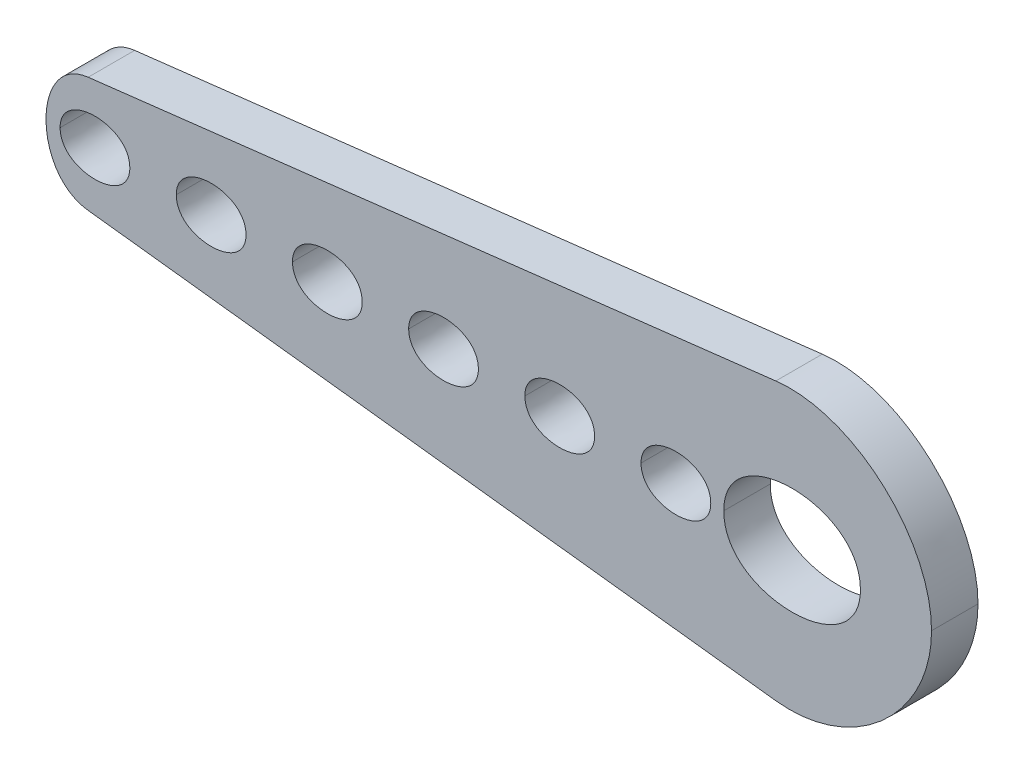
ISO-10303-21;
HEADER;
FILE_DESCRIPTION(('STEP AP214'),'2;1');
FILE_NAME('part.step','',(''),(''),'','','');
FILE_SCHEMA(('AUTOMOTIVE_DESIGN { 1 0 10303 214 1 1 1 1 }'));
ENDSEC;
DATA;
#1=APPLICATION_CONTEXT('core data for automotive mechanical design processes');
#2=APPLICATION_PROTOCOL_DEFINITION('international standard','automotive_design',2000,#1);
#3=PRODUCT_CONTEXT('',#1,'mechanical');
#4=PRODUCT('Part','Part','',(#3));
#5=PRODUCT_RELATED_PRODUCT_CATEGORY('part','',(#4));
#6=PRODUCT_DEFINITION_FORMATION('','',#4);
#7=PRODUCT_DEFINITION_CONTEXT('part definition',#1,'design');
#8=PRODUCT_DEFINITION('design','',#6,#7);
#9=PRODUCT_DEFINITION_SHAPE('','',#8);
#10=(LENGTH_UNIT() NAMED_UNIT(*) SI_UNIT(.MILLI.,.METRE.));
#11=(NAMED_UNIT(*) PLANE_ANGLE_UNIT() SI_UNIT($,.RADIAN.));
#12=(NAMED_UNIT(*) SI_UNIT($,.STERADIAN.) SOLID_ANGLE_UNIT());
#13=UNCERTAINTY_MEASURE_WITH_UNIT(LENGTH_MEASURE(1.E-05),#10,'distance_accuracy_value','');
#14=(GEOMETRIC_REPRESENTATION_CONTEXT(3) GLOBAL_UNCERTAINTY_ASSIGNED_CONTEXT((#13)) GLOBAL_UNIT_ASSIGNED_CONTEXT((#10,
#11,#12)) REPRESENTATION_CONTEXT('',''));
#15=CARTESIAN_POINT('',(0.,0.,0.));
#16=DIRECTION('',(0.,0.,1.));
#17=DIRECTION('',(1.,0.,0.));
#18=AXIS2_PLACEMENT_3D('',#15,#16,#17);
#19=CARTESIAN_POINT('',(-2.07030057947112,-2.48292080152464,0.));
#20=CARTESIAN_POINT('',(7.79356408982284,-3.64166624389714,0.));
#21=CARTESIAN_POINT('',(17.6574665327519,-4.80033307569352,0.));
#22=CARTESIAN_POINT('',(27.5213652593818,-5.95902676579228,0.));
#23=B_SPLINE_CURVE_WITH_KNOTS('',3,(#19,#20,#21,#22),.UNSPECIFIED.,.F.,.F.,(4,4),(0.,1.),.UNSPECIFIED.);
#24=DIRECTION('',(0.,0.,1.));
#25=VECTOR('',#24,1.);
#26=SURFACE_OF_LINEAR_EXTRUSION('',#23,#25);
#27=CARTESIAN_POINT('',(-2.07030057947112,-2.48292080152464,2.));
#28=CARTESIAN_POINT('',(7.79356408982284,-3.64166624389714,2.));
#29=CARTESIAN_POINT('',(17.6574665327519,-4.80033307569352,2.));
#30=CARTESIAN_POINT('',(27.5213652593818,-5.95902676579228,2.));
#31=B_SPLINE_CURVE_WITH_KNOTS('',3,(#27,#28,#29,#30),.UNSPECIFIED.,.F.,.F.,(4,4),(0.,1.),.UNSPECIFIED.);
#32=CARTESIAN_POINT('',(-2.07030057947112,-2.48292080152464,2.));
#33=VERTEX_POINT('',#32);
#34=CARTESIAN_POINT('',(27.5213652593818,-5.95902676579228,2.));
#35=VERTEX_POINT('',#34);
#36=EDGE_CURVE('E412',#33,#35,#31,.T.);
#37=ORIENTED_EDGE('',*,*,#36,.F.);
#38=DIRECTION('',(0.,0.,1.));
#39=VECTOR('',#38,1.);
#40=CARTESIAN_POINT('',(-2.07030057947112,-2.48292080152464,0.));
#41=LINE('',#40,#39);
#42=CARTESIAN_POINT('',(-2.07030057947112,-2.48292080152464,0.));
#43=VERTEX_POINT('',#42);
#44=EDGE_CURVE('E11',#43,#33,#41,.T.);
#45=ORIENTED_EDGE('',*,*,#44,.F.);
#46=CARTESIAN_POINT('',(27.5213652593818,-5.95902676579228,0.));
#47=VERTEX_POINT('',#46);
#48=EDGE_CURVE('E452',#43,#47,#23,.T.);
#49=ORIENTED_EDGE('',*,*,#48,.T.);
#50=DIRECTION('',(0.,0.,1.));
#51=VECTOR('',#50,1.);
#52=CARTESIAN_POINT('',(27.5213652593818,-5.95902676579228,0.));
#53=LINE('',#52,#51);
#54=EDGE_CURVE('E37',#47,#35,#53,.T.);
#55=ORIENTED_EDGE('',*,*,#54,.T.);
#56=EDGE_LOOP('',(#37,#45,#49,#55));
#57=FACE_BOUND('',#56,.T.);
#58=ADVANCED_FACE('F33',(#57),#26,.T.);
#59=CARTESIAN_POINT('',(-2.07030002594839,2.4829160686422,0.));
#60=CARTESIAN_POINT('',(-4.49434606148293,2.19810123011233,0.));
#61=CARTESIAN_POINT('',(-4.48732922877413,-2.19895314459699,0.));
#62=CARTESIAN_POINT('',(-2.07030057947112,-2.48292080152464,0.));
#63=B_SPLINE_CURVE_WITH_KNOTS('',3,(#59,#60,#61,#62),.UNSPECIFIED.,.F.,.F.,(4,4),(0.,1.),.UNSPECIFIED.);
#64=DIRECTION('',(0.,0.,1.));
#65=VECTOR('',#64,1.);
#66=SURFACE_OF_LINEAR_EXTRUSION('',#63,#65);
#67=CARTESIAN_POINT('',(-2.07030002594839,2.4829160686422,2.));
#68=CARTESIAN_POINT('',(-4.49434606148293,2.19810123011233,2.));
#69=CARTESIAN_POINT('',(-4.48732922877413,-2.19895314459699,2.));
#70=CARTESIAN_POINT('',(-2.07030057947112,-2.48292080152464,2.));
#71=B_SPLINE_CURVE_WITH_KNOTS('',3,(#67,#68,#69,#70),.UNSPECIFIED.,.F.,.F.,(4,4),(0.,1.),.UNSPECIFIED.);
#72=CARTESIAN_POINT('',(-2.07030002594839,2.4829160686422,2.));
#73=VERTEX_POINT('',#72);
#74=EDGE_CURVE('E445',#73,#33,#71,.T.);
#75=ORIENTED_EDGE('',*,*,#74,.F.);
#76=DIRECTION('',(0.,0.,1.));
#77=VECTOR('',#76,1.);
#78=CARTESIAN_POINT('',(-2.07030002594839,2.4829160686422,0.));
#79=LINE('',#78,#77);
#80=CARTESIAN_POINT('',(-2.07030002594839,2.4829160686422,0.));
#81=VERTEX_POINT('',#80);
#82=EDGE_CURVE('E42',#81,#73,#79,.T.);
#83=ORIENTED_EDGE('',*,*,#82,.F.);
#84=EDGE_CURVE('E401',#81,#43,#63,.T.);
#85=ORIENTED_EDGE('',*,*,#84,.T.);
#86=ORIENTED_EDGE('',*,*,#44,.T.);
#87=EDGE_LOOP('',(#75,#83,#85,#86));
#88=FACE_BOUND('',#87,.T.);
#89=ADVANCED_FACE('F393',(#88),#66,.T.);
#90=CARTESIAN_POINT('',(27.5213652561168,5.95902676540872,0.));
#91=CARTESIAN_POINT('',(17.6574598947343,4.80033709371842,0.));
#92=CARTESIAN_POINT('',(7.79354792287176,3.64169226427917,0.));
#93=CARTESIAN_POINT('',(-2.07030002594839,2.4829160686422,0.));
#94=B_SPLINE_CURVE_WITH_KNOTS('',3,(#90,#91,#92,#93),.UNSPECIFIED.,.F.,.F.,(4,4),(0.,1.),.UNSPECIFIED.);
#95=DIRECTION('',(0.,0.,1.));
#96=VECTOR('',#95,1.);
#97=SURFACE_OF_LINEAR_EXTRUSION('',#94,#96);
#98=CARTESIAN_POINT('',(27.5213652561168,5.95902676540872,2.));
#99=CARTESIAN_POINT('',(17.6574598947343,4.80033709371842,2.));
#100=CARTESIAN_POINT('',(7.79354792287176,3.64169226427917,2.));
#101=CARTESIAN_POINT('',(-2.07030002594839,2.4829160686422,2.));
#102=B_SPLINE_CURVE_WITH_KNOTS('',3,(#98,#99,#100,#101),.UNSPECIFIED.,.F.,.F.,(4,4),(0.,1.),.UNSPECIFIED.);
#103=CARTESIAN_POINT('',(27.5213652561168,5.95902676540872,2.));
#104=VERTEX_POINT('',#103);
#105=EDGE_CURVE('E437',#104,#73,#102,.T.);
#106=ORIENTED_EDGE('',*,*,#105,.F.);
#107=DIRECTION('',(0.,0.,1.));
#108=VECTOR('',#107,1.);
#109=CARTESIAN_POINT('',(27.5213652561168,5.95902676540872,0.));
#110=LINE('',#109,#108);
#111=CARTESIAN_POINT('',(27.5213652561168,5.95902676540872,0.));
#112=VERTEX_POINT('',#111);
#113=EDGE_CURVE('E458',#112,#104,#110,.T.);
#114=ORIENTED_EDGE('',*,*,#113,.F.);
#115=EDGE_CURVE('E407',#112,#81,#94,.T.);
#116=ORIENTED_EDGE('',*,*,#115,.T.);
#117=ORIENTED_EDGE('',*,*,#82,.T.);
#118=EDGE_LOOP('',(#106,#114,#116,#117));
#119=FACE_BOUND('',#118,.T.);
#120=ADVANCED_FACE('F397',(#119),#97,.T.);
#121=CARTESIAN_POINT('',(34.2213544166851,-3.87570184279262E-10,0.));
#122=CARTESIAN_POINT('',(34.2212300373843,3.32809834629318,0.));
#123=CARTESIAN_POINT('',(30.891057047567,6.354568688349,0.));
#124=CARTESIAN_POINT('',(27.5213652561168,5.95902676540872,0.));
#125=B_SPLINE_CURVE_WITH_KNOTS('',3,(#121,#122,#123,#124),.UNSPECIFIED.,.F.,.F.,(4,4),(0.,1.),.UNSPECIFIED.);
#126=DIRECTION('',(0.,0.,1.));
#127=VECTOR('',#126,1.);
#128=SURFACE_OF_LINEAR_EXTRUSION('',#125,#127);
#129=CARTESIAN_POINT('',(34.2213544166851,-3.87570184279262E-10,2.));
#130=CARTESIAN_POINT('',(34.2212300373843,3.32809834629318,2.));
#131=CARTESIAN_POINT('',(30.891057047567,6.354568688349,2.));
#132=CARTESIAN_POINT('',(27.5213652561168,5.95902676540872,2.));
#133=B_SPLINE_CURVE_WITH_KNOTS('',3,(#129,#130,#131,#132),.UNSPECIFIED.,.F.,.F.,(4,4),(0.,1.),.UNSPECIFIED.);
#134=CARTESIAN_POINT('',(34.2213544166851,-3.87570184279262E-10,2.));
#135=VERTEX_POINT('',#134);
#136=EDGE_CURVE('E429',#135,#104,#133,.T.);
#137=ORIENTED_EDGE('',*,*,#136,.F.);
#138=DIRECTION('',(0.,0.,1.));
#139=VECTOR('',#138,1.);
#140=CARTESIAN_POINT('',(34.2213544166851,-3.87570184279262E-10,0.));
#141=LINE('',#140,#139);
#142=CARTESIAN_POINT('',(34.2213544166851,-3.87570184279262E-10,0.));
#143=VERTEX_POINT('',#142);
#144=EDGE_CURVE('E459',#143,#135,#141,.T.);
#145=ORIENTED_EDGE('',*,*,#144,.F.);
#146=EDGE_CURVE('E478',#143,#112,#125,.T.);
#147=ORIENTED_EDGE('',*,*,#146,.T.);
#148=ORIENTED_EDGE('',*,*,#113,.T.);
#149=EDGE_LOOP('',(#137,#145,#147,#148));
#150=FACE_BOUND('',#149,.T.);
#151=ADVANCED_FACE('F499',(#150),#128,.T.);
#152=CARTESIAN_POINT('',(27.5213652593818,-5.95902676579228,0.));
#153=CARTESIAN_POINT('',(30.8889448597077,-6.35432075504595,0.));
#154=CARTESIAN_POINT('',(34.2214681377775,-3.32435910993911,0.));
#155=CARTESIAN_POINT('',(34.2213544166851,-3.87570184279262E-10,0.));
#156=B_SPLINE_CURVE_WITH_KNOTS('',3,(#152,#153,#154,#155),.UNSPECIFIED.,.F.,.F.,(4,4),(0.,1.),.UNSPECIFIED.);
#157=DIRECTION('',(0.,0.,1.));
#158=VECTOR('',#157,1.);
#159=SURFACE_OF_LINEAR_EXTRUSION('',#156,#158);
#160=CARTESIAN_POINT('',(27.5213652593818,-5.95902676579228,2.));
#161=CARTESIAN_POINT('',(30.8889448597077,-6.35432075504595,2.));
#162=CARTESIAN_POINT('',(34.2214681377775,-3.32435910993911,2.));
#163=CARTESIAN_POINT('',(34.2213544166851,-3.87570184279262E-10,2.));
#164=B_SPLINE_CURVE_WITH_KNOTS('',3,(#160,#161,#162,#163),.UNSPECIFIED.,.F.,.F.,(4,4),(0.,1.),.UNSPECIFIED.);
#165=EDGE_CURVE('E420',#35,#135,#164,.T.);
#166=ORIENTED_EDGE('',*,*,#165,.F.);
#167=ORIENTED_EDGE('',*,*,#54,.F.);
#168=EDGE_CURVE('E477',#47,#143,#156,.T.);
#169=ORIENTED_EDGE('',*,*,#168,.T.);
#170=ORIENTED_EDGE('',*,*,#144,.T.);
#171=EDGE_LOOP('',(#166,#167,#169,#170));
#172=FACE_BOUND('',#171,.T.);
#173=ADVANCED_FACE('F389',(#172),#159,.T.);
#174=CARTESIAN_POINT('',(12.7255195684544,-4.22099319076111,0.));
#175=DIRECTION('',(0.,0.,-1.));
#176=DIRECTION('',(-1.,0.,0.));
#177=AXIS2_PLACEMENT_3D('',#174,#175,#176);
#178=PLANE('',#177);
#179=CARTESIAN_POINT('',(9.72136526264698,0.,0.));
#180=CARTESIAN_POINT('',(9.72136526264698,1.57079632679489,0.));
#181=CARTESIAN_POINT('',(6.72136526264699,1.5707963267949,0.));
#182=CARTESIAN_POINT('',(6.72136526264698,0.,0.));
#183=B_SPLINE_CURVE_WITH_KNOTS('',3,(#179,#180,#181,#182),.UNSPECIFIED.,.F.,.F.,(4,4),(0.,1.),.UNSPECIFIED.);
#184=CARTESIAN_POINT('',(9.72136526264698,0.,0.));
#185=VERTEX_POINT('',#184);
#186=CARTESIAN_POINT('',(6.72136526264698,0.,0.));
#187=VERTEX_POINT('',#186);
#188=EDGE_CURVE('E50',#185,#187,#183,.T.);
#189=ORIENTED_EDGE('',*,*,#188,.T.);
#190=CARTESIAN_POINT('',(6.72136526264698,0.,0.));
#191=CARTESIAN_POINT('',(6.72136526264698,-1.5707963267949,0.));
#192=CARTESIAN_POINT('',(9.72136526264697,-1.5707963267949,0.));
#193=CARTESIAN_POINT('',(9.72136526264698,0.,0.));
#194=B_SPLINE_CURVE_WITH_KNOTS('',3,(#190,#191,#192,#193),.UNSPECIFIED.,.F.,.F.,(4,4),(0.,1.),.UNSPECIFIED.);
#195=EDGE_CURVE('E168',#187,#185,#194,.T.);
#196=ORIENTED_EDGE('',*,*,#195,.T.);
#197=EDGE_LOOP('',(#189,#196));
#198=FACE_BOUND('',#197,.T.);
#199=CARTESIAN_POINT('',(4.72136526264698,0.,0.));
#200=CARTESIAN_POINT('',(4.72136526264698,1.57079632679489,0.));
#201=CARTESIAN_POINT('',(1.72136526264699,1.5707963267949,0.));
#202=CARTESIAN_POINT('',(1.72136526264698,0.,0.));
#203=B_SPLINE_CURVE_WITH_KNOTS('',3,(#199,#200,#201,#202),.UNSPECIFIED.,.F.,.F.,(4,4),(0.,1.),.UNSPECIFIED.);
#204=CARTESIAN_POINT('',(4.72136526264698,0.,0.));
#205=VERTEX_POINT('',#204);
#206=CARTESIAN_POINT('',(1.72136526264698,0.,0.));
#207=VERTEX_POINT('',#206);
#208=EDGE_CURVE('E208',#205,#207,#203,.T.);
#209=ORIENTED_EDGE('',*,*,#208,.T.);
#210=CARTESIAN_POINT('',(1.72136526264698,0.,0.));
#211=CARTESIAN_POINT('',(1.72136526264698,-1.5707963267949,0.));
#212=CARTESIAN_POINT('',(4.72136526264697,-1.5707963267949,0.));
#213=CARTESIAN_POINT('',(4.72136526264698,0.,0.));
#214=B_SPLINE_CURVE_WITH_KNOTS('',3,(#210,#211,#212,#213),.UNSPECIFIED.,.F.,.F.,(4,4),(0.,1.),.UNSPECIFIED.);
#215=EDGE_CURVE('E201',#207,#205,#214,.T.);
#216=ORIENTED_EDGE('',*,*,#215,.T.);
#217=EDGE_LOOP('',(#209,#216));
#218=FACE_BOUND('',#217,.T.);
#219=CARTESIAN_POINT('',(-0.27863473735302,0.,0.));
#220=CARTESIAN_POINT('',(-0.278634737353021,1.5707963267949,0.));
#221=CARTESIAN_POINT('',(-3.27863473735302,1.5707963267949,0.));
#222=CARTESIAN_POINT('',(-3.27863473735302,0.,0.));
#223=B_SPLINE_CURVE_WITH_KNOTS('',3,(#219,#220,#221,#222),.UNSPECIFIED.,.F.,.F.,(4,4),(0.,1.),.UNSPECIFIED.);
#224=CARTESIAN_POINT('',(-0.27863473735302,0.,0.));
#225=VERTEX_POINT('',#224);
#226=CARTESIAN_POINT('',(-3.27863473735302,0.,0.));
#227=VERTEX_POINT('',#226);
#228=EDGE_CURVE('E235',#225,#227,#223,.T.);
#229=ORIENTED_EDGE('',*,*,#228,.T.);
#230=CARTESIAN_POINT('',(-3.27863473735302,0.,0.));
#231=CARTESIAN_POINT('',(-3.27863473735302,-1.5707963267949,0.));
#232=CARTESIAN_POINT('',(-0.278634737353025,-1.5707963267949,0.));
#233=CARTESIAN_POINT('',(-0.27863473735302,0.,0.));
#234=B_SPLINE_CURVE_WITH_KNOTS('',3,(#230,#231,#232,#233),.UNSPECIFIED.,.F.,.F.,(4,4),(0.,1.),.UNSPECIFIED.);
#235=EDGE_CURVE('E241',#227,#225,#234,.T.);
#236=ORIENTED_EDGE('',*,*,#235,.T.);
#237=EDGE_LOOP('',(#229,#236));
#238=FACE_BOUND('',#237,.T.);
#239=CARTESIAN_POINT('',(14.721365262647,0.,0.));
#240=CARTESIAN_POINT('',(14.721365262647,1.5707963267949,0.));
#241=CARTESIAN_POINT('',(11.721365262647,1.5707963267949,0.));
#242=CARTESIAN_POINT('',(11.721365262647,0.,0.));
#243=B_SPLINE_CURVE_WITH_KNOTS('',3,(#239,#240,#241,#242),.UNSPECIFIED.,.F.,.F.,(4,4),(0.,1.),.UNSPECIFIED.);
#244=CARTESIAN_POINT('',(14.721365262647,0.,0.));
#245=VERTEX_POINT('',#244);
#246=CARTESIAN_POINT('',(11.721365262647,0.,0.));
#247=VERTEX_POINT('',#246);
#248=EDGE_CURVE('E271',#245,#247,#243,.T.);
#249=ORIENTED_EDGE('',*,*,#248,.T.);
#250=CARTESIAN_POINT('',(11.721365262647,0.,0.));
#251=CARTESIAN_POINT('',(11.721365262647,-1.5707963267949,0.));
#252=CARTESIAN_POINT('',(14.721365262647,-1.5707963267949,0.));
#253=CARTESIAN_POINT('',(14.721365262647,0.,0.));
#254=B_SPLINE_CURVE_WITH_KNOTS('',3,(#250,#251,#252,#253),.UNSPECIFIED.,.F.,.F.,(4,4),(0.,1.),.UNSPECIFIED.);
#255=EDGE_CURVE('E264',#247,#245,#254,.T.);
#256=ORIENTED_EDGE('',*,*,#255,.T.);
#257=EDGE_LOOP('',(#249,#256));
#258=FACE_BOUND('',#257,.T.);
#259=CARTESIAN_POINT('',(19.721365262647,0.,0.));
#260=CARTESIAN_POINT('',(19.721365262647,1.5707963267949,0.));
#261=CARTESIAN_POINT('',(16.721365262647,1.5707963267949,0.));
#262=CARTESIAN_POINT('',(16.721365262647,0.,0.));
#263=B_SPLINE_CURVE_WITH_KNOTS('',3,(#259,#260,#261,#262),.UNSPECIFIED.,.F.,.F.,(4,4),(0.,1.),.UNSPECIFIED.);
#264=CARTESIAN_POINT('',(19.721365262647,0.,0.));
#265=VERTEX_POINT('',#264);
#266=CARTESIAN_POINT('',(16.721365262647,0.,0.));
#267=VERTEX_POINT('',#266);
#268=EDGE_CURVE('E300',#265,#267,#263,.T.);
#269=ORIENTED_EDGE('',*,*,#268,.T.);
#270=CARTESIAN_POINT('',(16.721365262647,0.,0.));
#271=CARTESIAN_POINT('',(16.721365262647,-1.5707963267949,0.));
#272=CARTESIAN_POINT('',(19.721365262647,-1.5707963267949,0.));
#273=CARTESIAN_POINT('',(19.721365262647,0.,0.));
#274=B_SPLINE_CURVE_WITH_KNOTS('',3,(#270,#271,#272,#273),.UNSPECIFIED.,.F.,.F.,(4,4),(0.,1.),.UNSPECIFIED.);
#275=EDGE_CURVE('E306',#267,#265,#274,.T.);
#276=ORIENTED_EDGE('',*,*,#275,.T.);
#277=EDGE_LOOP('',(#269,#276));
#278=FACE_BOUND('',#277,.T.);
#279=CARTESIAN_POINT('',(24.721365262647,0.,0.));
#280=CARTESIAN_POINT('',(24.721365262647,1.5707963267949,0.));
#281=CARTESIAN_POINT('',(21.721365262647,1.5707963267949,0.));
#282=CARTESIAN_POINT('',(21.721365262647,0.,0.));
#283=B_SPLINE_CURVE_WITH_KNOTS('',3,(#279,#280,#281,#282),.UNSPECIFIED.,.F.,.F.,(4,4),(0.,1.),.UNSPECIFIED.);
#284=CARTESIAN_POINT('',(24.721365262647,0.,0.));
#285=VERTEX_POINT('',#284);
#286=CARTESIAN_POINT('',(21.721365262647,0.,0.));
#287=VERTEX_POINT('',#286);
#288=EDGE_CURVE('E336',#285,#287,#283,.T.);
#289=ORIENTED_EDGE('',*,*,#288,.T.);
#290=CARTESIAN_POINT('',(21.721365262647,0.,0.));
#291=CARTESIAN_POINT('',(21.721365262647,-1.5707963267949,0.));
#292=CARTESIAN_POINT('',(24.721365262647,-1.5707963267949,0.));
#293=CARTESIAN_POINT('',(24.721365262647,0.,0.));
#294=B_SPLINE_CURVE_WITH_KNOTS('',3,(#290,#291,#292,#293),.UNSPECIFIED.,.F.,.F.,(4,4),(0.,1.),.UNSPECIFIED.);
#295=EDGE_CURVE('E329',#287,#285,#294,.T.);
#296=ORIENTED_EDGE('',*,*,#295,.T.);
#297=EDGE_LOOP('',(#289,#296));
#298=FACE_BOUND('',#297,.T.);
#299=CARTESIAN_POINT('',(31.161365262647,0.,0.));
#300=CARTESIAN_POINT('',(31.161365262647,3.07876080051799,0.));
#301=CARTESIAN_POINT('',(25.281365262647,3.078760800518,0.));
#302=CARTESIAN_POINT('',(25.281365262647,0.,0.));
#303=B_SPLINE_CURVE_WITH_KNOTS('',3,(#299,#300,#301,#302),.UNSPECIFIED.,.F.,.F.,(4,4),(0.,1.),.UNSPECIFIED.);
#304=CARTESIAN_POINT('',(31.161365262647,0.,0.));
#305=VERTEX_POINT('',#304);
#306=CARTESIAN_POINT('',(25.281365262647,0.,0.));
#307=VERTEX_POINT('',#306);
#308=EDGE_CURVE('E365',#305,#307,#303,.T.);
#309=ORIENTED_EDGE('',*,*,#308,.T.);
#310=CARTESIAN_POINT('',(25.281365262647,0.,0.));
#311=CARTESIAN_POINT('',(25.281365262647,-3.07876080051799,0.));
#312=CARTESIAN_POINT('',(31.161365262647,-3.078760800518,0.));
#313=CARTESIAN_POINT('',(31.161365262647,0.,0.));
#314=B_SPLINE_CURVE_WITH_KNOTS('',3,(#310,#311,#312,#313),.UNSPECIFIED.,.F.,.F.,(4,4),(0.,1.),.UNSPECIFIED.);
#315=EDGE_CURVE('E371',#307,#305,#314,.T.);
#316=ORIENTED_EDGE('',*,*,#315,.T.);
#317=EDGE_LOOP('',(#309,#316));
#318=FACE_BOUND('',#317,.T.);
#319=ORIENTED_EDGE('',*,*,#48,.F.);
#320=ORIENTED_EDGE('',*,*,#84,.F.);
#321=ORIENTED_EDGE('',*,*,#115,.F.);
#322=ORIENTED_EDGE('',*,*,#146,.F.);
#323=ORIENTED_EDGE('',*,*,#168,.F.);
#324=EDGE_LOOP('',(#319,#320,#321,#322,#323));
#325=FACE_BOUND('',#324,.T.);
#326=ADVANCED_FACE('F174',(#198,#218,#238,#258,#278,#298,#318,#325),#178,.T.);
#327=CARTESIAN_POINT('',(12.7255195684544,-4.22099319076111,2.));
#328=DIRECTION('',(0.,0.,-1.));
#329=DIRECTION('',(-1.,0.,0.));
#330=AXIS2_PLACEMENT_3D('',#327,#328,#329);
#331=PLANE('',#330);
#332=CARTESIAN_POINT('',(6.72136526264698,0.,2.));
#333=CARTESIAN_POINT('',(6.72136526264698,-1.5707963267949,2.));
#334=CARTESIAN_POINT('',(9.72136526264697,-1.5707963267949,2.));
#335=CARTESIAN_POINT('',(9.72136526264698,0.,2.));
#336=B_SPLINE_CURVE_WITH_KNOTS('',3,(#332,#333,#334,#335),.UNSPECIFIED.,.F.,.F.,(4,4),(0.,1.),.UNSPECIFIED.);
#337=CARTESIAN_POINT('',(6.72136526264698,0.,2.));
#338=VERTEX_POINT('',#337);
#339=CARTESIAN_POINT('',(9.72136526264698,0.,2.));
#340=VERTEX_POINT('',#339);
#341=EDGE_CURVE('E176',#338,#340,#336,.T.);
#342=ORIENTED_EDGE('',*,*,#341,.F.);
#343=CARTESIAN_POINT('',(9.72136526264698,0.,2.));
#344=CARTESIAN_POINT('',(9.72136526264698,1.57079632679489,2.));
#345=CARTESIAN_POINT('',(6.72136526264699,1.5707963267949,2.));
#346=CARTESIAN_POINT('',(6.72136526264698,0.,2.));
#347=B_SPLINE_CURVE_WITH_KNOTS('',3,(#343,#344,#345,#346),.UNSPECIFIED.,.F.,.F.,(4,4),(0.,1.),.UNSPECIFIED.);
#348=EDGE_CURVE('E55',#340,#338,#347,.T.);
#349=ORIENTED_EDGE('',*,*,#348,.F.);
#350=EDGE_LOOP('',(#342,#349));
#351=FACE_BOUND('',#350,.T.);
#352=CARTESIAN_POINT('',(1.72136526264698,0.,2.));
#353=CARTESIAN_POINT('',(1.72136526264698,-1.5707963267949,2.));
#354=CARTESIAN_POINT('',(4.72136526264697,-1.5707963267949,2.));
#355=CARTESIAN_POINT('',(4.72136526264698,0.,2.));
#356=B_SPLINE_CURVE_WITH_KNOTS('',3,(#352,#353,#354,#355),.UNSPECIFIED.,.F.,.F.,(4,4),(0.,1.),.UNSPECIFIED.);
#357=CARTESIAN_POINT('',(1.72136526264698,0.,2.));
#358=VERTEX_POINT('',#357);
#359=CARTESIAN_POINT('',(4.72136526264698,0.,2.));
#360=VERTEX_POINT('',#359);
#361=EDGE_CURVE('E219',#358,#360,#356,.T.);
#362=ORIENTED_EDGE('',*,*,#361,.F.);
#363=CARTESIAN_POINT('',(4.72136526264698,0.,2.));
#364=CARTESIAN_POINT('',(4.72136526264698,1.57079632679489,2.));
#365=CARTESIAN_POINT('',(1.72136526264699,1.5707963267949,2.));
#366=CARTESIAN_POINT('',(1.72136526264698,0.,2.));
#367=B_SPLINE_CURVE_WITH_KNOTS('',3,(#363,#364,#365,#366),.UNSPECIFIED.,.F.,.F.,(4,4),(0.,1.),.UNSPECIFIED.);
#368=EDGE_CURVE('E212',#360,#358,#367,.T.);
#369=ORIENTED_EDGE('',*,*,#368,.F.);
#370=EDGE_LOOP('',(#362,#369));
#371=FACE_BOUND('',#370,.T.);
#372=CARTESIAN_POINT('',(-3.27863473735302,0.,2.));
#373=CARTESIAN_POINT('',(-3.27863473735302,-1.5707963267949,2.));
#374=CARTESIAN_POINT('',(-0.278634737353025,-1.5707963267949,2.));
#375=CARTESIAN_POINT('',(-0.27863473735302,0.,2.));
#376=B_SPLINE_CURVE_WITH_KNOTS('',3,(#372,#373,#374,#375),.UNSPECIFIED.,.F.,.F.,(4,4),(0.,1.),.UNSPECIFIED.);
#377=CARTESIAN_POINT('',(-3.27863473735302,0.,2.));
#378=VERTEX_POINT('',#377);
#379=CARTESIAN_POINT('',(-0.27863473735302,0.,2.));
#380=VERTEX_POINT('',#379);
#381=EDGE_CURVE('E242',#378,#380,#376,.T.);
#382=ORIENTED_EDGE('',*,*,#381,.F.);
#383=CARTESIAN_POINT('',(-0.27863473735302,0.,2.));
#384=CARTESIAN_POINT('',(-0.278634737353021,1.5707963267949,2.));
#385=CARTESIAN_POINT('',(-3.27863473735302,1.5707963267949,2.));
#386=CARTESIAN_POINT('',(-3.27863473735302,0.,2.));
#387=B_SPLINE_CURVE_WITH_KNOTS('',3,(#383,#384,#385,#386),.UNSPECIFIED.,.F.,.F.,(4,4),(0.,1.),.UNSPECIFIED.);
#388=EDGE_CURVE('E232',#380,#378,#387,.T.);
#389=ORIENTED_EDGE('',*,*,#388,.F.);
#390=EDGE_LOOP('',(#382,#389));
#391=FACE_BOUND('',#390,.T.);
#392=CARTESIAN_POINT('',(11.721365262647,0.,2.));
#393=CARTESIAN_POINT('',(11.721365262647,-1.5707963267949,2.));
#394=CARTESIAN_POINT('',(14.721365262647,-1.5707963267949,2.));
#395=CARTESIAN_POINT('',(14.721365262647,0.,2.));
#396=B_SPLINE_CURVE_WITH_KNOTS('',3,(#392,#393,#394,#395),.UNSPECIFIED.,.F.,.F.,(4,4),(0.,1.),.UNSPECIFIED.);
#397=CARTESIAN_POINT('',(11.721365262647,0.,2.));
#398=VERTEX_POINT('',#397);
#399=CARTESIAN_POINT('',(14.721365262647,0.,2.));
#400=VERTEX_POINT('',#399);
#401=EDGE_CURVE('E283',#398,#400,#396,.T.);
#402=ORIENTED_EDGE('',*,*,#401,.F.);
#403=CARTESIAN_POINT('',(14.721365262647,0.,2.));
#404=CARTESIAN_POINT('',(14.721365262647,1.5707963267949,2.));
#405=CARTESIAN_POINT('',(11.721365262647,1.5707963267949,2.));
#406=CARTESIAN_POINT('',(11.721365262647,0.,2.));
#407=B_SPLINE_CURVE_WITH_KNOTS('',3,(#403,#404,#405,#406),.UNSPECIFIED.,.F.,.F.,(4,4),(0.,1.),.UNSPECIFIED.);
#408=EDGE_CURVE('E276',#400,#398,#407,.T.);
#409=ORIENTED_EDGE('',*,*,#408,.F.);
#410=EDGE_LOOP('',(#402,#409));
#411=FACE_BOUND('',#410,.T.);
#412=CARTESIAN_POINT('',(16.721365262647,0.,2.));
#413=CARTESIAN_POINT('',(16.721365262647,-1.5707963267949,2.));
#414=CARTESIAN_POINT('',(19.721365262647,-1.5707963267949,2.));
#415=CARTESIAN_POINT('',(19.721365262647,0.,2.));
#416=B_SPLINE_CURVE_WITH_KNOTS('',3,(#412,#413,#414,#415),.UNSPECIFIED.,.F.,.F.,(4,4),(0.,1.),.UNSPECIFIED.);
#417=CARTESIAN_POINT('',(16.721365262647,0.,2.));
#418=VERTEX_POINT('',#417);
#419=CARTESIAN_POINT('',(19.721365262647,0.,2.));
#420=VERTEX_POINT('',#419);
#421=EDGE_CURVE('E307',#418,#420,#416,.T.);
#422=ORIENTED_EDGE('',*,*,#421,.F.);
#423=CARTESIAN_POINT('',(19.721365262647,0.,2.));
#424=CARTESIAN_POINT('',(19.721365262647,1.5707963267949,2.));
#425=CARTESIAN_POINT('',(16.721365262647,1.5707963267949,2.));
#426=CARTESIAN_POINT('',(16.721365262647,0.,2.));
#427=B_SPLINE_CURVE_WITH_KNOTS('',3,(#423,#424,#425,#426),.UNSPECIFIED.,.F.,.F.,(4,4),(0.,1.),.UNSPECIFIED.);
#428=EDGE_CURVE('E297',#420,#418,#427,.T.);
#429=ORIENTED_EDGE('',*,*,#428,.F.);
#430=EDGE_LOOP('',(#422,#429));
#431=FACE_BOUND('',#430,.T.);
#432=CARTESIAN_POINT('',(21.721365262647,0.,2.));
#433=CARTESIAN_POINT('',(21.721365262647,-1.5707963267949,2.));
#434=CARTESIAN_POINT('',(24.721365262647,-1.5707963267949,2.));
#435=CARTESIAN_POINT('',(24.721365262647,0.,2.));
#436=B_SPLINE_CURVE_WITH_KNOTS('',3,(#432,#433,#434,#435),.UNSPECIFIED.,.F.,.F.,(4,4),(0.,1.),.UNSPECIFIED.);
#437=CARTESIAN_POINT('',(21.721365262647,0.,2.));
#438=VERTEX_POINT('',#437);
#439=CARTESIAN_POINT('',(24.721365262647,0.,2.));
#440=VERTEX_POINT('',#439);
#441=EDGE_CURVE('E348',#438,#440,#436,.T.);
#442=ORIENTED_EDGE('',*,*,#441,.F.);
#443=CARTESIAN_POINT('',(24.721365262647,0.,2.));
#444=CARTESIAN_POINT('',(24.721365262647,1.5707963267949,2.));
#445=CARTESIAN_POINT('',(21.721365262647,1.5707963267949,2.));
#446=CARTESIAN_POINT('',(21.721365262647,0.,2.));
#447=B_SPLINE_CURVE_WITH_KNOTS('',3,(#443,#444,#445,#446),.UNSPECIFIED.,.F.,.F.,(4,4),(0.,1.),.UNSPECIFIED.);
#448=EDGE_CURVE('E341',#440,#438,#447,.T.);
#449=ORIENTED_EDGE('',*,*,#448,.F.);
#450=EDGE_LOOP('',(#442,#449));
#451=FACE_BOUND('',#450,.T.);
#452=CARTESIAN_POINT('',(25.281365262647,0.,2.));
#453=CARTESIAN_POINT('',(25.281365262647,-3.07876080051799,2.));
#454=CARTESIAN_POINT('',(31.161365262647,-3.078760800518,2.));
#455=CARTESIAN_POINT('',(31.161365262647,0.,2.));
#456=B_SPLINE_CURVE_WITH_KNOTS('',3,(#452,#453,#454,#455),.UNSPECIFIED.,.F.,.F.,(4,4),(0.,1.),.UNSPECIFIED.);
#457=CARTESIAN_POINT('',(25.281365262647,0.,2.));
#458=VERTEX_POINT('',#457);
#459=CARTESIAN_POINT('',(31.161365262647,0.,2.));
#460=VERTEX_POINT('',#459);
#461=EDGE_CURVE('E372',#458,#460,#456,.T.);
#462=ORIENTED_EDGE('',*,*,#461,.F.);
#463=CARTESIAN_POINT('',(31.161365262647,0.,2.));
#464=CARTESIAN_POINT('',(31.161365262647,3.07876080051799,2.));
#465=CARTESIAN_POINT('',(25.281365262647,3.078760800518,2.));
#466=CARTESIAN_POINT('',(25.281365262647,0.,2.));
#467=B_SPLINE_CURVE_WITH_KNOTS('',3,(#463,#464,#465,#466),.UNSPECIFIED.,.F.,.F.,(4,4),(0.,1.),.UNSPECIFIED.);
#468=EDGE_CURVE('E362',#460,#458,#467,.T.);
#469=ORIENTED_EDGE('',*,*,#468,.F.);
#470=EDGE_LOOP('',(#462,#469));
#471=FACE_BOUND('',#470,.T.);
#472=ORIENTED_EDGE('',*,*,#36,.T.);
#473=ORIENTED_EDGE('',*,*,#165,.T.);
#474=ORIENTED_EDGE('',*,*,#136,.T.);
#475=ORIENTED_EDGE('',*,*,#105,.T.);
#476=ORIENTED_EDGE('',*,*,#74,.T.);
#477=EDGE_LOOP('',(#472,#473,#474,#475,#476));
#478=FACE_BOUND('',#477,.T.);
#479=ADVANCED_FACE('F385',(#351,#371,#391,#411,#431,#451,#471,#478),#331,.F.);
#480=DIRECTION('',(0.,0.,1.));
#481=VECTOR('',#480,1.);
#482=SURFACE_OF_LINEAR_EXTRUSION('',#303,#481);
#483=ORIENTED_EDGE('',*,*,#468,.T.);
#484=DIRECTION('',(0.,0.,1.));
#485=VECTOR('',#484,1.);
#486=CARTESIAN_POINT('',(25.281365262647,0.,0.));
#487=LINE('',#486,#485);
#488=EDGE_CURVE('E484',#307,#458,#487,.T.);
#489=ORIENTED_EDGE('',*,*,#488,.F.);
#490=ORIENTED_EDGE('',*,*,#308,.F.);
#491=DIRECTION('',(0.,0.,1.));
#492=VECTOR('',#491,1.);
#493=CARTESIAN_POINT('',(31.161365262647,0.,0.));
#494=LINE('',#493,#492);
#495=EDGE_CURVE('E421',#305,#460,#494,.T.);
#496=ORIENTED_EDGE('',*,*,#495,.T.);
#497=EDGE_LOOP('',(#483,#489,#490,#496));
#498=FACE_BOUND('',#497,.T.);
#499=ADVANCED_FACE('F381',(#498),#482,.F.);
#500=DIRECTION('',(0.,0.,1.));
#501=VECTOR('',#500,1.);
#502=SURFACE_OF_LINEAR_EXTRUSION('',#314,#501);
#503=ORIENTED_EDGE('',*,*,#461,.T.);
#504=ORIENTED_EDGE('',*,*,#495,.F.);
#505=ORIENTED_EDGE('',*,*,#315,.F.);
#506=ORIENTED_EDGE('',*,*,#488,.T.);
#507=EDGE_LOOP('',(#503,#504,#505,#506));
#508=FACE_BOUND('',#507,.T.);
#509=ADVANCED_FACE('F384',(#508),#502,.F.);
#510=DIRECTION('',(0.,0.,1.));
#511=VECTOR('',#510,1.);
#512=SURFACE_OF_LINEAR_EXTRUSION('',#283,#511);
#513=ORIENTED_EDGE('',*,*,#448,.T.);
#514=DIRECTION('',(0.,0.,1.));
#515=VECTOR('',#514,1.);
#516=CARTESIAN_POINT('',(21.721365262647,0.,0.));
#517=LINE('',#516,#515);
#518=EDGE_CURVE('E335',#287,#438,#517,.T.);
#519=ORIENTED_EDGE('',*,*,#518,.F.);
#520=ORIENTED_EDGE('',*,*,#288,.F.);
#521=DIRECTION('',(0.,0.,1.));
#522=VECTOR('',#521,1.);
#523=CARTESIAN_POINT('',(24.721365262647,0.,0.));
#524=LINE('',#523,#522);
#525=EDGE_CURVE('E357',#285,#440,#524,.T.);
#526=ORIENTED_EDGE('',*,*,#525,.T.);
#527=EDGE_LOOP('',(#513,#519,#520,#526));
#528=FACE_BOUND('',#527,.T.);
#529=ADVANCED_FACE('F325',(#528),#512,.F.);
#530=DIRECTION('',(0.,0.,1.));
#531=VECTOR('',#530,1.);
#532=SURFACE_OF_LINEAR_EXTRUSION('',#294,#531);
#533=ORIENTED_EDGE('',*,*,#441,.T.);
#534=ORIENTED_EDGE('',*,*,#525,.F.);
#535=ORIENTED_EDGE('',*,*,#295,.F.);
#536=ORIENTED_EDGE('',*,*,#518,.T.);
#537=EDGE_LOOP('',(#533,#534,#535,#536));
#538=FACE_BOUND('',#537,.T.);
#539=ADVANCED_FACE('F320',(#538),#532,.F.);
#540=DIRECTION('',(0.,0.,1.));
#541=VECTOR('',#540,1.);
#542=SURFACE_OF_LINEAR_EXTRUSION('',#263,#541);
#543=ORIENTED_EDGE('',*,*,#428,.T.);
#544=DIRECTION('',(0.,0.,1.));
#545=VECTOR('',#544,1.);
#546=CARTESIAN_POINT('',(16.721365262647,0.,0.));
#547=LINE('',#546,#545);
#548=EDGE_CURVE('E695',#267,#418,#547,.T.);
#549=ORIENTED_EDGE('',*,*,#548,.F.);
#550=ORIENTED_EDGE('',*,*,#268,.F.);
#551=DIRECTION('',(0.,0.,1.));
#552=VECTOR('',#551,1.);
#553=CARTESIAN_POINT('',(19.721365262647,0.,0.));
#554=LINE('',#553,#552);
#555=EDGE_CURVE('E349',#265,#420,#554,.T.);
#556=ORIENTED_EDGE('',*,*,#555,.T.);
#557=EDGE_LOOP('',(#543,#549,#550,#556));
#558=FACE_BOUND('',#557,.T.);
#559=ADVANCED_FACE('F316',(#558),#542,.F.);
#560=DIRECTION('',(0.,0.,1.));
#561=VECTOR('',#560,1.);
#562=SURFACE_OF_LINEAR_EXTRUSION('',#274,#561);
#563=ORIENTED_EDGE('',*,*,#421,.T.);
#564=ORIENTED_EDGE('',*,*,#555,.F.);
#565=ORIENTED_EDGE('',*,*,#275,.F.);
#566=ORIENTED_EDGE('',*,*,#548,.T.);
#567=EDGE_LOOP('',(#563,#564,#565,#566));
#568=FACE_BOUND('',#567,.T.);
#569=ADVANCED_FACE('F319',(#568),#562,.F.);
#570=DIRECTION('',(0.,0.,1.));
#571=VECTOR('',#570,1.);
#572=SURFACE_OF_LINEAR_EXTRUSION('',#243,#571);
#573=ORIENTED_EDGE('',*,*,#408,.T.);
#574=DIRECTION('',(0.,0.,1.));
#575=VECTOR('',#574,1.);
#576=CARTESIAN_POINT('',(11.721365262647,0.,0.));
#577=LINE('',#576,#575);
#578=EDGE_CURVE('E270',#247,#398,#577,.T.);
#579=ORIENTED_EDGE('',*,*,#578,.F.);
#580=ORIENTED_EDGE('',*,*,#248,.F.);
#581=DIRECTION('',(0.,0.,1.));
#582=VECTOR('',#581,1.);
#583=CARTESIAN_POINT('',(14.721365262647,0.,0.));
#584=LINE('',#583,#582);
#585=EDGE_CURVE('E292',#245,#400,#584,.T.);
#586=ORIENTED_EDGE('',*,*,#585,.T.);
#587=EDGE_LOOP('',(#573,#579,#580,#586));
#588=FACE_BOUND('',#587,.T.);
#589=ADVANCED_FACE('F260',(#588),#572,.F.);
#590=DIRECTION('',(0.,0.,1.));
#591=VECTOR('',#590,1.);
#592=SURFACE_OF_LINEAR_EXTRUSION('',#254,#591);
#593=ORIENTED_EDGE('',*,*,#401,.T.);
#594=ORIENTED_EDGE('',*,*,#585,.F.);
#595=ORIENTED_EDGE('',*,*,#255,.F.);
#596=ORIENTED_EDGE('',*,*,#578,.T.);
#597=EDGE_LOOP('',(#593,#594,#595,#596));
#598=FACE_BOUND('',#597,.T.);
#599=ADVANCED_FACE('F255',(#598),#592,.F.);
#600=DIRECTION('',(0.,0.,1.));
#601=VECTOR('',#600,1.);
#602=SURFACE_OF_LINEAR_EXTRUSION('',#223,#601);
#603=ORIENTED_EDGE('',*,*,#388,.T.);
#604=DIRECTION('',(0.,0.,1.));
#605=VECTOR('',#604,1.);
#606=CARTESIAN_POINT('',(-3.27863473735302,0.,0.));
#607=LINE('',#606,#605);
#608=EDGE_CURVE('E717',#227,#378,#607,.T.);
#609=ORIENTED_EDGE('',*,*,#608,.F.);
#610=ORIENTED_EDGE('',*,*,#228,.F.);
#611=DIRECTION('',(0.,0.,1.));
#612=VECTOR('',#611,1.);
#613=CARTESIAN_POINT('',(-0.27863473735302,0.,0.));
#614=LINE('',#613,#612);
#615=EDGE_CURVE('E284',#225,#380,#614,.T.);
#616=ORIENTED_EDGE('',*,*,#615,.T.);
#617=EDGE_LOOP('',(#603,#609,#610,#616));
#618=FACE_BOUND('',#617,.T.);
#619=ADVANCED_FACE('F251',(#618),#602,.F.);
#620=DIRECTION('',(0.,0.,1.));
#621=VECTOR('',#620,1.);
#622=SURFACE_OF_LINEAR_EXTRUSION('',#234,#621);
#623=ORIENTED_EDGE('',*,*,#381,.T.);
#624=ORIENTED_EDGE('',*,*,#615,.F.);
#625=ORIENTED_EDGE('',*,*,#235,.F.);
#626=ORIENTED_EDGE('',*,*,#608,.T.);
#627=EDGE_LOOP('',(#623,#624,#625,#626));
#628=FACE_BOUND('',#627,.T.);
#629=ADVANCED_FACE('F254',(#628),#622,.F.);
#630=DIRECTION('',(0.,0.,1.));
#631=VECTOR('',#630,1.);
#632=SURFACE_OF_LINEAR_EXTRUSION('',#203,#631);
#633=ORIENTED_EDGE('',*,*,#368,.T.);
#634=DIRECTION('',(0.,0.,1.));
#635=VECTOR('',#634,1.);
#636=CARTESIAN_POINT('',(1.72136526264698,0.,0.));
#637=LINE('',#636,#635);
#638=EDGE_CURVE('E207',#207,#358,#637,.T.);
#639=ORIENTED_EDGE('',*,*,#638,.F.);
#640=ORIENTED_EDGE('',*,*,#208,.F.);
#641=DIRECTION('',(0.,0.,1.));
#642=VECTOR('',#641,1.);
#643=CARTESIAN_POINT('',(4.72136526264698,0.,0.));
#644=LINE('',#643,#642);
#645=EDGE_CURVE('E227',#205,#360,#644,.T.);
#646=ORIENTED_EDGE('',*,*,#645,.T.);
#647=EDGE_LOOP('',(#633,#639,#640,#646));
#648=FACE_BOUND('',#647,.T.);
#649=ADVANCED_FACE('F197',(#648),#632,.F.);
#650=DIRECTION('',(0.,0.,1.));
#651=VECTOR('',#650,1.);
#652=SURFACE_OF_LINEAR_EXTRUSION('',#214,#651);
#653=ORIENTED_EDGE('',*,*,#361,.T.);
#654=ORIENTED_EDGE('',*,*,#645,.F.);
#655=ORIENTED_EDGE('',*,*,#215,.F.);
#656=ORIENTED_EDGE('',*,*,#638,.T.);
#657=EDGE_LOOP('',(#653,#654,#655,#656));
#658=FACE_BOUND('',#657,.T.);
#659=ADVANCED_FACE('F193',(#658),#652,.F.);
#660=DIRECTION('',(0.,0.,1.));
#661=VECTOR('',#660,1.);
#662=SURFACE_OF_LINEAR_EXTRUSION('',#183,#661);
#663=ORIENTED_EDGE('',*,*,#348,.T.);
#664=DIRECTION('',(0.,0.,1.));
#665=VECTOR('',#664,1.);
#666=CARTESIAN_POINT('',(6.72136526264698,0.,0.));
#667=LINE('',#666,#665);
#668=EDGE_CURVE('E161',#187,#338,#667,.T.);
#669=ORIENTED_EDGE('',*,*,#668,.F.);
#670=ORIENTED_EDGE('',*,*,#188,.F.);
#671=DIRECTION('',(0.,0.,1.));
#672=VECTOR('',#671,1.);
#673=CARTESIAN_POINT('',(9.72136526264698,0.,0.));
#674=LINE('',#673,#672);
#675=EDGE_CURVE('E167',#185,#340,#674,.T.);
#676=ORIENTED_EDGE('',*,*,#675,.T.);
#677=EDGE_LOOP('',(#663,#669,#670,#676));
#678=FACE_BOUND('',#677,.T.);
#679=ADVANCED_FACE('F163',(#678),#662,.F.);
#680=DIRECTION('',(0.,0.,1.));
#681=VECTOR('',#680,1.);
#682=SURFACE_OF_LINEAR_EXTRUSION('',#194,#681);
#683=ORIENTED_EDGE('',*,*,#341,.T.);
#684=ORIENTED_EDGE('',*,*,#675,.F.);
#685=ORIENTED_EDGE('',*,*,#195,.F.);
#686=ORIENTED_EDGE('',*,*,#668,.T.);
#687=EDGE_LOOP('',(#683,#684,#685,#686));
#688=FACE_BOUND('',#687,.T.);
#689=ADVANCED_FACE('F171',(#688),#682,.F.);
#690=CLOSED_SHELL('',(#58,#89,#120,#151,#173,#326,#479,#499,#509,#529,#539,#559,#569,#589,#599,
#619,#629,#649,#659,#679,#689));
#691=MANIFOLD_SOLID_BREP('B2',#690);
#692=ADVANCED_BREP_SHAPE_REPRESENTATION('',(#18,#691),#14);
#693=SHAPE_DEFINITION_REPRESENTATION(#9,#692);
ENDSEC;
END-ISO-10303-21;
